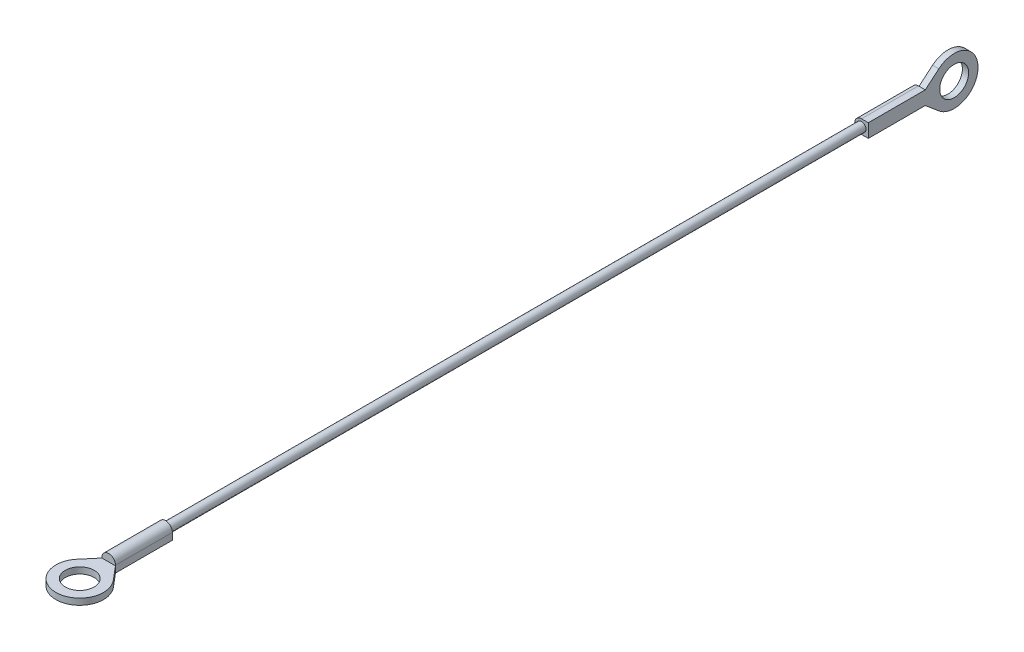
ISO-10303-21;
HEADER;
FILE_DESCRIPTION(('STEP AP214'),'2;1');
FILE_NAME('part.step','',(''),(''),'','','');
FILE_SCHEMA(('AUTOMOTIVE_DESIGN { 1 0 10303 214 1 1 1 1 }'));
ENDSEC;
DATA;
#1=APPLICATION_CONTEXT('core data for automotive mechanical design processes');
#2=APPLICATION_PROTOCOL_DEFINITION('international standard','automotive_design',2000,#1);
#3=PRODUCT_CONTEXT('',#1,'mechanical');
#4=PRODUCT('Part','Part','',(#3));
#5=PRODUCT_RELATED_PRODUCT_CATEGORY('part','',(#4));
#6=PRODUCT_DEFINITION_FORMATION('','',#4);
#7=PRODUCT_DEFINITION_CONTEXT('part definition',#1,'design');
#8=PRODUCT_DEFINITION('design','',#6,#7);
#9=PRODUCT_DEFINITION_SHAPE('','',#8);
#10=(LENGTH_UNIT() NAMED_UNIT(*) SI_UNIT(.MILLI.,.METRE.));
#11=(NAMED_UNIT(*) PLANE_ANGLE_UNIT() SI_UNIT($,.RADIAN.));
#12=(NAMED_UNIT(*) SI_UNIT($,.STERADIAN.) SOLID_ANGLE_UNIT());
#13=UNCERTAINTY_MEASURE_WITH_UNIT(LENGTH_MEASURE(1.E-05),#10,'distance_accuracy_value','');
#14=(GEOMETRIC_REPRESENTATION_CONTEXT(3) GLOBAL_UNCERTAINTY_ASSIGNED_CONTEXT((#13)) GLOBAL_UNIT_ASSIGNED_CONTEXT((#10,
#11,#12)) REPRESENTATION_CONTEXT('',''));
#15=CARTESIAN_POINT('',(0.,0.,0.));
#16=DIRECTION('',(0.,0.,1.));
#17=DIRECTION('',(1.,0.,0.));
#18=AXIS2_PLACEMENT_3D('',#15,#16,#17);
#19=CARTESIAN_POINT('',(0.,0.,-71.12));
#20=DIRECTION('',(0.,0.,-1.));
#21=DIRECTION('',(-1.,0.,0.));
#22=AXIS2_PLACEMENT_3D('',#19,#20,#21);
#23=PLANE('',#22);
#24=DIRECTION('',(1.,0.,0.));
#25=VECTOR('',#24,1.);
#26=CARTESIAN_POINT('',(0.,1.195,-71.12));
#27=LINE('',#26,#25);
#28=CARTESIAN_POINT('',(0.,1.195,-71.12));
#29=VERTEX_POINT('',#28);
#30=CARTESIAN_POINT('',(0.095,1.195,-71.12));
#31=VERTEX_POINT('',#30);
#32=EDGE_CURVE('E195',#29,#31,#27,.T.);
#33=ORIENTED_EDGE('',*,*,#32,.T.);
#34=DIRECTION('',(0.,-1.,0.));
#35=VECTOR('',#34,1.);
#36=CARTESIAN_POINT('',(0.095,-1.195,-71.12));
#37=LINE('',#36,#35);
#38=CARTESIAN_POINT('',(0.095,-1.195,-71.12));
#39=VERTEX_POINT('',#38);
#40=EDGE_CURVE('E153',#31,#39,#37,.T.);
#41=ORIENTED_EDGE('',*,*,#40,.T.);
#42=DIRECTION('',(-1.,0.,0.));
#43=VECTOR('',#42,1.);
#44=CARTESIAN_POINT('',(1.195,-1.195,-71.12));
#45=LINE('',#44,#43);
#46=CARTESIAN_POINT('',(0.,-1.195,-71.12));
#47=VERTEX_POINT('',#46);
#48=EDGE_CURVE('E200',#39,#47,#45,.T.);
#49=ORIENTED_EDGE('',*,*,#48,.T.);
#50=CARTESIAN_POINT('',(0.,0.,-71.12));
#51=DIRECTION('',(0.,0.,-1.));
#52=DIRECTION('',(-1.,0.,0.));
#53=AXIS2_PLACEMENT_3D('',#50,#51,#52);
#54=CIRCLE('',#53,1.195);
#55=EDGE_CURVE('E191',#47,#29,#54,.T.);
#56=ORIENTED_EDGE('',*,*,#55,.T.);
#57=EDGE_LOOP('',(#33,#41,#49,#56));
#58=FACE_BOUND('',#57,.T.);
#59=ADVANCED_FACE('F38',(#58),#23,.T.);
#60=CARTESIAN_POINT('',(0.,0.,71.12));
#61=DIRECTION('',(0.,0.,1.));
#62=DIRECTION('',(1.,0.,0.));
#63=AXIS2_PLACEMENT_3D('',#60,#61,#62);
#64=PLANE('',#63);
#65=DIRECTION('',(0.,-1.,0.));
#66=VECTOR('',#65,1.);
#67=CARTESIAN_POINT('',(-1.195,0.,71.12));
#68=LINE('',#67,#66);
#69=CARTESIAN_POINT('',(-1.195,0.,71.12));
#70=VERTEX_POINT('',#69);
#71=CARTESIAN_POINT('',(-1.195,-0.095,71.12));
#72=VERTEX_POINT('',#71);
#73=EDGE_CURVE('E279',#70,#72,#68,.T.);
#74=ORIENTED_EDGE('',*,*,#73,.T.);
#75=DIRECTION('',(1.,0.,0.));
#76=VECTOR('',#75,1.);
#77=CARTESIAN_POINT('',(-1.195,-0.095,71.12));
#78=LINE('',#77,#76);
#79=CARTESIAN_POINT('',(1.195,-0.095,71.12));
#80=VERTEX_POINT('',#79);
#81=EDGE_CURVE('E240',#72,#80,#78,.T.);
#82=ORIENTED_EDGE('',*,*,#81,.T.);
#83=DIRECTION('',(0.,1.,0.));
#84=VECTOR('',#83,1.);
#85=CARTESIAN_POINT('',(1.195,-1.195,71.12));
#86=LINE('',#85,#84);
#87=CARTESIAN_POINT('',(1.195,0.,71.12));
#88=VERTEX_POINT('',#87);
#89=EDGE_CURVE('E284',#80,#88,#86,.T.);
#90=ORIENTED_EDGE('',*,*,#89,.T.);
#91=CARTESIAN_POINT('',(0.,0.,71.12));
#92=DIRECTION('',(0.,0.,1.));
#93=DIRECTION('',(1.,0.,0.));
#94=AXIS2_PLACEMENT_3D('',#91,#92,#93);
#95=CIRCLE('',#94,1.195);
#96=EDGE_CURVE('E275',#88,#70,#95,.T.);
#97=ORIENTED_EDGE('',*,*,#96,.T.);
#98=EDGE_LOOP('',(#74,#82,#90,#97));
#99=FACE_BOUND('',#98,.T.);
#100=ADVANCED_FACE('F338',(#99),#64,.T.);
#101=CARTESIAN_POINT('',(0.,0.,61.12));
#102=DIRECTION('',(0.,0.,-1.));
#103=DIRECTION('',(-1.,0.,0.));
#104=AXIS2_PLACEMENT_3D('',#101,#102,#103);
#105=CYLINDRICAL_SURFACE('',#104,0.795);
#106=CARTESIAN_POINT('',(0.,0.,61.12));
#107=DIRECTION('',(0.,0.,1.));
#108=DIRECTION('',(1.,0.,0.));
#109=AXIS2_PLACEMENT_3D('',#106,#107,#108);
#110=CIRCLE('',#109,0.795);
#111=CARTESIAN_POINT('',(-0.795,0.,61.12));
#112=VERTEX_POINT('',#111);
#113=EDGE_CURVE('E11',#112,#112,#110,.T.);
#114=CARTESIAN_POINT('',(0.,0.,-61.12));
#115=DIRECTION('',(0.,0.,1.));
#116=DIRECTION('',(1.,0.,0.));
#117=AXIS2_PLACEMENT_3D('',#114,#115,#116);
#118=CIRCLE('',#117,0.795);
#119=CARTESIAN_POINT('',(-0.795,0.,-61.12));
#120=VERTEX_POINT('',#119);
#121=EDGE_CURVE('E42',#120,#120,#118,.T.);
#122=CARTESIAN_POINT('',(-0.795,0.,61.12));
#123=CARTESIAN_POINT('',(-0.795,0.,59.8466666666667));
#124=CARTESIAN_POINT('',(-0.795,0.,58.5733333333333));
#125=CARTESIAN_POINT('',(-0.795,0.,56.0266666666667));
#126=CARTESIAN_POINT('',(-0.795,0.,54.7533333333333));
#127=CARTESIAN_POINT('',(-0.795,0.,52.2066666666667));
#128=CARTESIAN_POINT('',(-0.795,0.,50.9333333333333));
#129=CARTESIAN_POINT('',(-0.795,0.,48.3866666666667));
#130=CARTESIAN_POINT('',(-0.795,0.,47.1133333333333));
#131=CARTESIAN_POINT('',(-0.795,0.,44.5666666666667));
#132=CARTESIAN_POINT('',(-0.795,0.,43.2933333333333));
#133=CARTESIAN_POINT('',(-0.795,0.,40.7466666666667));
#134=CARTESIAN_POINT('',(-0.795,0.,39.4733333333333));
#135=CARTESIAN_POINT('',(-0.795,0.,36.9266666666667));
#136=CARTESIAN_POINT('',(-0.795,0.,35.6533333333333));
#137=CARTESIAN_POINT('',(-0.795,0.,33.1066666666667));
#138=CARTESIAN_POINT('',(-0.795,0.,31.8333333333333));
#139=CARTESIAN_POINT('',(-0.795,0.,29.2866666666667));
#140=CARTESIAN_POINT('',(-0.795,0.,28.0133333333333));
#141=CARTESIAN_POINT('',(-0.795,0.,25.4666666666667));
#142=CARTESIAN_POINT('',(-0.795,0.,24.1933333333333));
#143=CARTESIAN_POINT('',(-0.795,0.,21.6466666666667));
#144=CARTESIAN_POINT('',(-0.795,0.,20.3733333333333));
#145=CARTESIAN_POINT('',(-0.795,0.,17.8266666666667));
#146=CARTESIAN_POINT('',(-0.795,0.,16.5533333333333));
#147=CARTESIAN_POINT('',(-0.795,0.,14.0066666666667));
#148=CARTESIAN_POINT('',(-0.795,0.,12.7333333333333));
#149=CARTESIAN_POINT('',(-0.795,0.,10.1866666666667));
#150=CARTESIAN_POINT('',(-0.795,0.,8.91333333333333));
#151=CARTESIAN_POINT('',(-0.795,0.,6.36666666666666));
#152=CARTESIAN_POINT('',(-0.795,0.,5.09333333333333));
#153=CARTESIAN_POINT('',(-0.795,0.,2.54666666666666));
#154=CARTESIAN_POINT('',(-0.795,0.,1.27333333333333));
#155=CARTESIAN_POINT('',(-0.795,0.,-1.27333333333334));
#156=CARTESIAN_POINT('',(-0.795,0.,-2.54666666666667));
#157=CARTESIAN_POINT('',(-0.795,0.,-5.09333333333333));
#158=CARTESIAN_POINT('',(-0.795,0.,-6.36666666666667));
#159=CARTESIAN_POINT('',(-0.795,0.,-8.91333333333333));
#160=CARTESIAN_POINT('',(-0.795,0.,-10.1866666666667));
#161=CARTESIAN_POINT('',(-0.795,0.,-12.7333333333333));
#162=CARTESIAN_POINT('',(-0.795,0.,-14.0066666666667));
#163=CARTESIAN_POINT('',(-0.795,0.,-16.5533333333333));
#164=CARTESIAN_POINT('',(-0.795,0.,-17.8266666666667));
#165=CARTESIAN_POINT('',(-0.795,0.,-20.3733333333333));
#166=CARTESIAN_POINT('',(-0.795,0.,-21.6466666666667));
#167=CARTESIAN_POINT('',(-0.795,0.,-24.1933333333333));
#168=CARTESIAN_POINT('',(-0.795,0.,-25.4666666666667));
#169=CARTESIAN_POINT('',(-0.795,0.,-28.0133333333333));
#170=CARTESIAN_POINT('',(-0.795,0.,-29.2866666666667));
#171=CARTESIAN_POINT('',(-0.795,0.,-31.8333333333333));
#172=CARTESIAN_POINT('',(-0.795,0.,-33.1066666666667));
#173=CARTESIAN_POINT('',(-0.795,0.,-35.6533333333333));
#174=CARTESIAN_POINT('',(-0.795,0.,-36.9266666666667));
#175=CARTESIAN_POINT('',(-0.795,0.,-39.4733333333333));
#176=CARTESIAN_POINT('',(-0.795,0.,-40.7466666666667));
#177=CARTESIAN_POINT('',(-0.795,0.,-43.2933333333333));
#178=CARTESIAN_POINT('',(-0.795,0.,-44.5666666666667));
#179=CARTESIAN_POINT('',(-0.795,0.,-47.1133333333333));
#180=CARTESIAN_POINT('',(-0.795,0.,-48.3866666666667));
#181=CARTESIAN_POINT('',(-0.795,0.,-50.9333333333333));
#182=CARTESIAN_POINT('',(-0.795,0.,-52.2066666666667));
#183=CARTESIAN_POINT('',(-0.795,0.,-54.7533333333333));
#184=CARTESIAN_POINT('',(-0.795,0.,-56.0266666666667));
#185=CARTESIAN_POINT('',(-0.795,0.,-58.5733333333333));
#186=CARTESIAN_POINT('',(-0.795,0.,-59.8466666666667));
#187=CARTESIAN_POINT('',(-0.795,0.,-61.12));
#188=B_SPLINE_CURVE_WITH_KNOTS('',3,(#122,#123,#124,#125,#126,#127,#128,#129,#130,#131,#132,
#133,#134,#135,#136,#137,#138,#139,#140,#141,#142,#143,#144,#145,#146,#147,#148,#149,#150,#151,
#152,#153,#154,#155,#156,#157,#158,#159,#160,#161,#162,#163,#164,#165,#166,#167,#168,#169,#170,
#171,#172,#173,#174,#175,#176,#177,#178,#179,#180,#181,#182,#183,#184,#185,#186,#187),
.UNSPECIFIED.,.F.,.F.,(4,2,2,2,2,2,2,2,2,2,2,2,2,2,2,2,2,2,2,2,2,2,2,2,2,2,2,2,2,2,2,2,4),(0.,
3.82,7.63999999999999,11.46,15.28,19.1,22.92,26.74,30.56,34.38,38.2,42.02,45.84,49.66,53.48,
57.3,61.12,64.94,68.76,72.58,76.4,80.22,84.04,87.86,91.68,95.5,99.32,103.14,106.96,110.78,114.6,
118.42,122.24),.UNSPECIFIED.);
#189=EDGE_CURVE('BSEAM40',#112,#120,#188,.T.);
#190=ORIENTED_EDGE('',*,*,#113,.F.);
#191=ORIENTED_EDGE('',*,*,#121,.T.);
#192=ORIENTED_EDGE('',*,*,#189,.T.);
#193=ORIENTED_EDGE('',*,*,#189,.F.);
#194=EDGE_LOOP('',(#190,#192,#191,#193));
#195=FACE_BOUND('',#194,.T.);
#196=ADVANCED_FACE('F40',(#195),#105,.T.);
#197=CARTESIAN_POINT('',(0.,0.,71.12));
#198=DIRECTION('',(0.,0.,-1.));
#199=DIRECTION('',(-1.,0.,0.));
#200=AXIS2_PLACEMENT_3D('',#197,#198,#199);
#201=CYLINDRICAL_SURFACE('',#200,1.195);
#202=CARTESIAN_POINT('',(0.,0.,61.12));
#203=DIRECTION('',(0.,0.,1.));
#204=DIRECTION('',(1.,0.,0.));
#205=AXIS2_PLACEMENT_3D('',#202,#203,#204);
#206=CIRCLE('',#205,1.195);
#207=CARTESIAN_POINT('',(1.195,0.,61.12));
#208=VERTEX_POINT('',#207);
#209=CARTESIAN_POINT('',(-1.195,0.,61.12));
#210=VERTEX_POINT('',#209);
#211=EDGE_CURVE('E269',#208,#210,#206,.T.);
#212=ORIENTED_EDGE('',*,*,#211,.T.);
#213=DIRECTION('',(0.,0.,-1.));
#214=VECTOR('',#213,1.);
#215=CARTESIAN_POINT('',(-1.195,0.,71.12));
#216=LINE('',#215,#214);
#217=EDGE_CURVE('E48',#70,#210,#216,.T.);
#218=ORIENTED_EDGE('',*,*,#217,.F.);
#219=ORIENTED_EDGE('',*,*,#96,.F.);
#220=DIRECTION('',(0.,0.,-1.));
#221=VECTOR('',#220,1.);
#222=CARTESIAN_POINT('',(1.195,0.,71.12));
#223=LINE('',#222,#221);
#224=EDGE_CURVE('E288',#88,#208,#223,.T.);
#225=ORIENTED_EDGE('',*,*,#224,.T.);
#226=EDGE_LOOP('',(#212,#218,#219,#225));
#227=FACE_BOUND('',#226,.T.);
#228=ADVANCED_FACE('F322',(#227),#201,.T.);
#229=CARTESIAN_POINT('',(-1.195,0.,71.12));
#230=DIRECTION('',(1.,0.,0.));
#231=DIRECTION('',(0.,1.,0.));
#232=AXIS2_PLACEMENT_3D('',#229,#230,#231);
#233=PLANE('',#232);
#234=DIRECTION('',(0.,-1.,0.));
#235=VECTOR('',#234,1.);
#236=CARTESIAN_POINT('',(-1.195,0.,61.12));
#237=LINE('',#236,#235);
#238=CARTESIAN_POINT('',(-1.195,-1.195,61.12));
#239=VERTEX_POINT('',#238);
#240=EDGE_CURVE('E292',#210,#239,#237,.T.);
#241=ORIENTED_EDGE('',*,*,#240,.T.);
#242=DIRECTION('',(0.,0.,-1.));
#243=VECTOR('',#242,1.);
#244=CARTESIAN_POINT('',(-1.195,-1.195,71.12));
#245=LINE('',#244,#243);
#246=CARTESIAN_POINT('',(-1.195,-1.195,71.12));
#247=VERTEX_POINT('',#246);
#248=EDGE_CURVE('E308',#247,#239,#245,.T.);
#249=ORIENTED_EDGE('',*,*,#248,.F.);
#250=DIRECTION('',(0.,-1.,0.));
#251=VECTOR('',#250,1.);
#252=CARTESIAN_POINT('',(-1.195,-0.095,71.12));
#253=LINE('',#252,#251);
#254=EDGE_CURVE('E266',#72,#247,#253,.T.);
#255=ORIENTED_EDGE('',*,*,#254,.F.);
#256=ORIENTED_EDGE('',*,*,#73,.F.);
#257=ORIENTED_EDGE('',*,*,#217,.T.);
#258=EDGE_LOOP('',(#241,#249,#255,#256,#257));
#259=FACE_BOUND('',#258,.T.);
#260=ADVANCED_FACE('F316',(#259),#233,.F.);
#261=CARTESIAN_POINT('',(0.,-1.195,71.12));
#262=DIRECTION('',(0.,1.,0.));
#263=DIRECTION('',(0.,0.,1.));
#264=AXIS2_PLACEMENT_3D('',#261,#262,#263);
#265=PLANE('',#264);
#266=DIRECTION('',(1.,0.,0.));
#267=VECTOR('',#266,1.);
#268=CARTESIAN_POINT('',(0.,-1.195,61.12));
#269=LINE('',#268,#267);
#270=CARTESIAN_POINT('',(1.195,-1.195,61.12));
#271=VERTEX_POINT('',#270);
#272=EDGE_CURVE('E296',#239,#271,#269,.T.);
#273=ORIENTED_EDGE('',*,*,#272,.T.);
#274=DIRECTION('',(0.,0.,-1.));
#275=VECTOR('',#274,1.);
#276=CARTESIAN_POINT('',(1.195,-1.195,71.12));
#277=LINE('',#276,#275);
#278=CARTESIAN_POINT('',(1.195,-1.195,71.12));
#279=VERTEX_POINT('',#278);
#280=EDGE_CURVE('E304',#279,#271,#277,.T.);
#281=ORIENTED_EDGE('',*,*,#280,.F.);
#282=DIRECTION('',(0.645049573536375,0.,0.764140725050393));
#283=VECTOR('',#282,1.);
#284=CARTESIAN_POINT('',(1.195,-1.195,71.12));
#285=LINE('',#284,#283);
#286=CARTESIAN_POINT('',(3.20174963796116,-1.195,73.4972422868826));
#287=VERTEX_POINT('',#286);
#288=EDGE_CURVE('E235',#279,#287,#285,.T.);
#289=ORIENTED_EDGE('',*,*,#288,.T.);
#290=CARTESIAN_POINT('',(0.,-1.195,76.2));
#291=DIRECTION('',(0.,-1.,0.));
#292=DIRECTION('',(0.,0.,-1.));
#293=AXIS2_PLACEMENT_3D('',#290,#291,#292);
#294=CIRCLE('',#293,4.19000000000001);
#295=CARTESIAN_POINT('',(-3.20174963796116,-1.195,73.4972422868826));
#296=VERTEX_POINT('',#295);
#297=EDGE_CURVE('E259',#287,#296,#294,.T.);
#298=ORIENTED_EDGE('',*,*,#297,.T.);
#299=DIRECTION('',(0.645049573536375,0.,-0.764140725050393));
#300=VECTOR('',#299,1.);
#301=CARTESIAN_POINT('',(-3.20174963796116,-1.195,73.4972422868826));
#302=LINE('',#301,#300);
#303=EDGE_CURVE('E244',#296,#247,#302,.T.);
#304=ORIENTED_EDGE('',*,*,#303,.T.);
#305=ORIENTED_EDGE('',*,*,#248,.T.);
#306=EDGE_LOOP('',(#273,#281,#289,#298,#304,#305));
#307=FACE_BOUND('',#306,.T.);
#308=CARTESIAN_POINT('',(0.,-1.195,76.2));
#309=DIRECTION('',(0.,-1.,0.));
#310=DIRECTION('',(0.,0.,-1.));
#311=AXIS2_PLACEMENT_3D('',#308,#309,#310);
#312=CIRCLE('',#311,2.54);
#313=CARTESIAN_POINT('',(0.,-1.195,73.66));
#314=VERTEX_POINT('',#313);
#315=EDGE_CURVE('E236',#314,#314,#312,.T.);
#316=ORIENTED_EDGE('',*,*,#315,.F.);
#317=EDGE_LOOP('',(#316));
#318=FACE_BOUND('',#317,.T.);
#319=ADVANCED_FACE('F329',(#307,#318),#265,.F.);
#320=CARTESIAN_POINT('',(1.195,-1.195,71.12));
#321=DIRECTION('',(-1.,0.,0.));
#322=DIRECTION('',(0.,-1.,0.));
#323=AXIS2_PLACEMENT_3D('',#320,#321,#322);
#324=PLANE('',#323);
#325=DIRECTION('',(0.,1.,0.));
#326=VECTOR('',#325,1.);
#327=CARTESIAN_POINT('',(1.195,-1.195,61.12));
#328=LINE('',#327,#326);
#329=EDGE_CURVE('E280',#271,#208,#328,.T.);
#330=ORIENTED_EDGE('',*,*,#329,.T.);
#331=ORIENTED_EDGE('',*,*,#224,.F.);
#332=ORIENTED_EDGE('',*,*,#89,.F.);
#333=EDGE_CURVE('E285',#279,#80,#86,.T.);
#334=ORIENTED_EDGE('',*,*,#333,.F.);
#335=ORIENTED_EDGE('',*,*,#280,.T.);
#336=EDGE_LOOP('',(#330,#331,#332,#334,#335));
#337=FACE_BOUND('',#336,.T.);
#338=ADVANCED_FACE('F333',(#337),#324,.F.);
#339=CARTESIAN_POINT('',(0.,0.,61.12));
#340=DIRECTION('',(0.,0.,1.));
#341=DIRECTION('',(1.,0.,0.));
#342=AXIS2_PLACEMENT_3D('',#339,#340,#341);
#343=PLANE('',#342);
#344=ORIENTED_EDGE('',*,*,#113,.T.);
#345=EDGE_LOOP('',(#344));
#346=FACE_BOUND('',#345,.T.);
#347=ORIENTED_EDGE('',*,*,#211,.F.);
#348=ORIENTED_EDGE('',*,*,#329,.F.);
#349=ORIENTED_EDGE('',*,*,#272,.F.);
#350=ORIENTED_EDGE('',*,*,#240,.F.);
#351=EDGE_LOOP('',(#347,#348,#349,#350));
#352=FACE_BOUND('',#351,.T.);
#353=ADVANCED_FACE('F326',(#346,#352),#343,.F.);
#354=CARTESIAN_POINT('',(-3.20174963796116,-0.095,73.4972422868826));
#355=DIRECTION('',(-0.764140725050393,0.,-0.645049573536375));
#356=DIRECTION('',(-0.645049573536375,0.,0.764140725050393));
#357=AXIS2_PLACEMENT_3D('',#354,#355,#356);
#358=PLANE('',#357);
#359=ORIENTED_EDGE('',*,*,#303,.F.);
#360=DIRECTION('',(0.,-1.,0.));
#361=VECTOR('',#360,1.);
#362=CARTESIAN_POINT('',(-3.20174963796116,-0.095,73.4972422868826));
#363=LINE('',#362,#361);
#364=CARTESIAN_POINT('',(-3.20174963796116,-0.095,73.4972422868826));
#365=VERTEX_POINT('',#364);
#366=EDGE_CURVE('E270',#365,#296,#363,.T.);
#367=ORIENTED_EDGE('',*,*,#366,.F.);
#368=DIRECTION('',(0.645049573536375,0.,-0.764140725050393));
#369=VECTOR('',#368,1.);
#370=CARTESIAN_POINT('',(-3.20174963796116,-0.095,73.4972422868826));
#371=LINE('',#370,#369);
#372=EDGE_CURVE('E251',#365,#72,#371,.T.);
#373=ORIENTED_EDGE('',*,*,#372,.T.);
#374=ORIENTED_EDGE('',*,*,#254,.T.);
#375=EDGE_LOOP('',(#359,#367,#373,#374));
#376=FACE_BOUND('',#375,.T.);
#377=ADVANCED_FACE('F343',(#376),#358,.T.);
#378=CARTESIAN_POINT('',(0.,-0.095,76.2));
#379=DIRECTION('',(0.,-1.,0.));
#380=DIRECTION('',(0.,0.,-1.));
#381=AXIS2_PLACEMENT_3D('',#378,#379,#380);
#382=CYLINDRICAL_SURFACE('',#381,4.19000000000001);
#383=ORIENTED_EDGE('',*,*,#297,.F.);
#384=DIRECTION('',(0.,-1.,0.));
#385=VECTOR('',#384,1.);
#386=CARTESIAN_POINT('',(3.20174963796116,-0.095,73.4972422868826));
#387=LINE('',#386,#385);
#388=CARTESIAN_POINT('',(3.20174963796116,-0.095,73.4972422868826));
#389=VERTEX_POINT('',#388);
#390=EDGE_CURVE('E255',#389,#287,#387,.T.);
#391=ORIENTED_EDGE('',*,*,#390,.F.);
#392=CARTESIAN_POINT('',(0.,-0.095,76.2));
#393=DIRECTION('',(0.,-1.,0.));
#394=DIRECTION('',(0.,0.,-1.));
#395=AXIS2_PLACEMENT_3D('',#392,#393,#394);
#396=CIRCLE('',#395,4.19000000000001);
#397=EDGE_CURVE('E247',#389,#365,#396,.T.);
#398=ORIENTED_EDGE('',*,*,#397,.T.);
#399=ORIENTED_EDGE('',*,*,#366,.T.);
#400=EDGE_LOOP('',(#383,#391,#398,#399));
#401=FACE_BOUND('',#400,.T.);
#402=ADVANCED_FACE('F346',(#401),#382,.T.);
#403=CARTESIAN_POINT('',(1.195,-0.095,71.12));
#404=DIRECTION('',(0.764140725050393,0.,-0.645049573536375));
#405=DIRECTION('',(-0.645049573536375,0.,-0.764140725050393));
#406=AXIS2_PLACEMENT_3D('',#403,#404,#405);
#407=PLANE('',#406);
#408=ORIENTED_EDGE('',*,*,#288,.F.);
#409=ORIENTED_EDGE('',*,*,#333,.T.);
#410=DIRECTION('',(0.645049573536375,0.,0.764140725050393));
#411=VECTOR('',#410,1.);
#412=CARTESIAN_POINT('',(1.195,-0.095,71.12));
#413=LINE('',#412,#411);
#414=EDGE_CURVE('E63',#80,#389,#413,.T.);
#415=ORIENTED_EDGE('',*,*,#414,.T.);
#416=ORIENTED_EDGE('',*,*,#390,.T.);
#417=EDGE_LOOP('',(#408,#409,#415,#416));
#418=FACE_BOUND('',#417,.T.);
#419=ADVANCED_FACE('F336',(#418),#407,.T.);
#420=CARTESIAN_POINT('',(0.,-0.095,76.2));
#421=DIRECTION('',(0.,-1.,0.));
#422=DIRECTION('',(0.,0.,-1.));
#423=AXIS2_PLACEMENT_3D('',#420,#421,#422);
#424=PLANE('',#423);
#425=CARTESIAN_POINT('',(0.,-0.095,76.2));
#426=DIRECTION('',(0.,-1.,0.));
#427=DIRECTION('',(0.,0.,-1.));
#428=AXIS2_PLACEMENT_3D('',#425,#426,#427);
#429=CIRCLE('',#428,2.54);
#430=CARTESIAN_POINT('',(0.,-0.095,73.66));
#431=VERTEX_POINT('',#430);
#432=EDGE_CURVE('E231',#431,#431,#429,.T.);
#433=ORIENTED_EDGE('',*,*,#432,.T.);
#434=EDGE_LOOP('',(#433));
#435=FACE_BOUND('',#434,.T.);
#436=ORIENTED_EDGE('',*,*,#81,.F.);
#437=ORIENTED_EDGE('',*,*,#372,.F.);
#438=ORIENTED_EDGE('',*,*,#397,.F.);
#439=ORIENTED_EDGE('',*,*,#414,.F.);
#440=EDGE_LOOP('',(#436,#437,#438,#439));
#441=FACE_BOUND('',#440,.T.);
#442=ADVANCED_FACE('F340',(#435,#441),#424,.F.);
#443=CARTESIAN_POINT('',(0.,-0.095,76.2));
#444=DIRECTION('',(0.,-1.,0.));
#445=DIRECTION('',(0.,0.,-1.));
#446=AXIS2_PLACEMENT_3D('',#443,#444,#445);
#447=CYLINDRICAL_SURFACE('',#446,2.54);
#448=ORIENTED_EDGE('',*,*,#432,.F.);
#449=EDGE_LOOP('',(#448));
#450=FACE_BOUND('',#449,.T.);
#451=ORIENTED_EDGE('',*,*,#315,.T.);
#452=EDGE_LOOP('',(#451));
#453=FACE_BOUND('',#452,.T.);
#454=ADVANCED_FACE('F384',(#450,#453),#447,.F.);
#455=CARTESIAN_POINT('',(0.,0.,-71.12));
#456=DIRECTION('',(0.,0.,1.));
#457=DIRECTION('',(1.,0.,0.));
#458=AXIS2_PLACEMENT_3D('',#455,#456,#457);
#459=CYLINDRICAL_SURFACE('',#458,1.195);
#460=CARTESIAN_POINT('',(0.,0.,-61.12));
#461=DIRECTION('',(0.,0.,-1.));
#462=DIRECTION('',(-1.,0.,0.));
#463=AXIS2_PLACEMENT_3D('',#460,#461,#462);
#464=CIRCLE('',#463,1.195);
#465=CARTESIAN_POINT('',(0.,-1.195,-61.12));
#466=VERTEX_POINT('',#465);
#467=CARTESIAN_POINT('',(0.,1.195,-61.12));
#468=VERTEX_POINT('',#467);
#469=EDGE_CURVE('E188',#466,#468,#464,.T.);
#470=ORIENTED_EDGE('',*,*,#469,.T.);
#471=DIRECTION('',(0.,0.,1.));
#472=VECTOR('',#471,1.);
#473=CARTESIAN_POINT('',(0.,1.195,-71.12));
#474=LINE('',#473,#472);
#475=EDGE_CURVE('E227',#29,#468,#474,.T.);
#476=ORIENTED_EDGE('',*,*,#475,.F.);
#477=ORIENTED_EDGE('',*,*,#55,.F.);
#478=DIRECTION('',(0.,0.,1.));
#479=VECTOR('',#478,1.);
#480=CARTESIAN_POINT('',(0.,-1.195,-71.12));
#481=LINE('',#480,#479);
#482=EDGE_CURVE('E203',#47,#466,#481,.T.);
#483=ORIENTED_EDGE('',*,*,#482,.T.);
#484=EDGE_LOOP('',(#470,#476,#477,#483));
#485=FACE_BOUND('',#484,.T.);
#486=ADVANCED_FACE('F380',(#485),#459,.T.);
#487=CARTESIAN_POINT('',(0.,1.195,-71.12));
#488=DIRECTION('',(0.,-1.,0.));
#489=DIRECTION('',(0.,0.,-1.));
#490=AXIS2_PLACEMENT_3D('',#487,#488,#489);
#491=PLANE('',#490);
#492=DIRECTION('',(1.,0.,0.));
#493=VECTOR('',#492,1.);
#494=CARTESIAN_POINT('',(0.,1.195,-61.12));
#495=LINE('',#494,#493);
#496=CARTESIAN_POINT('',(1.195,1.195,-61.12));
#497=VERTEX_POINT('',#496);
#498=EDGE_CURVE('E207',#468,#497,#495,.T.);
#499=ORIENTED_EDGE('',*,*,#498,.T.);
#500=DIRECTION('',(0.,0.,1.));
#501=VECTOR('',#500,1.);
#502=CARTESIAN_POINT('',(1.195,1.195,-71.12));
#503=LINE('',#502,#501);
#504=CARTESIAN_POINT('',(1.195,1.195,-71.12));
#505=VERTEX_POINT('',#504);
#506=EDGE_CURVE('E223',#505,#497,#503,.T.);
#507=ORIENTED_EDGE('',*,*,#506,.F.);
#508=DIRECTION('',(1.,0.,0.));
#509=VECTOR('',#508,1.);
#510=CARTESIAN_POINT('',(0.095,1.195,-71.12));
#511=LINE('',#510,#509);
#512=EDGE_CURVE('E185',#31,#505,#511,.T.);
#513=ORIENTED_EDGE('',*,*,#512,.F.);
#514=ORIENTED_EDGE('',*,*,#32,.F.);
#515=ORIENTED_EDGE('',*,*,#475,.T.);
#516=EDGE_LOOP('',(#499,#507,#513,#514,#515));
#517=FACE_BOUND('',#516,.T.);
#518=ADVANCED_FACE('F376',(#517),#491,.F.);
#519=CARTESIAN_POINT('',(1.195,0.,-71.12));
#520=DIRECTION('',(-1.,0.,0.));
#521=DIRECTION('',(0.,-1.,0.));
#522=AXIS2_PLACEMENT_3D('',#519,#520,#521);
#523=PLANE('',#522);
#524=DIRECTION('',(0.,-1.,0.));
#525=VECTOR('',#524,1.);
#526=CARTESIAN_POINT('',(1.195,0.,-61.12));
#527=LINE('',#526,#525);
#528=CARTESIAN_POINT('',(1.195,-1.195,-61.12));
#529=VERTEX_POINT('',#528);
#530=EDGE_CURVE('E211',#497,#529,#527,.T.);
#531=ORIENTED_EDGE('',*,*,#530,.T.);
#532=DIRECTION('',(0.,0.,1.));
#533=VECTOR('',#532,1.);
#534=CARTESIAN_POINT('',(1.195,-1.195,-71.12));
#535=LINE('',#534,#533);
#536=CARTESIAN_POINT('',(1.195,-1.195,-71.12));
#537=VERTEX_POINT('',#536);
#538=EDGE_CURVE('E219',#537,#529,#535,.T.);
#539=ORIENTED_EDGE('',*,*,#538,.F.);
#540=DIRECTION('',(0.,-0.645049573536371,-0.764140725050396));
#541=VECTOR('',#540,1.);
#542=CARTESIAN_POINT('',(1.195,-3.20174963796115,-73.4972422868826));
#543=LINE('',#542,#541);
#544=CARTESIAN_POINT('',(1.195,-3.20174963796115,-73.4972422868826));
#545=VERTEX_POINT('',#544);
#546=EDGE_CURVE('E179',#537,#545,#543,.T.);
#547=ORIENTED_EDGE('',*,*,#546,.T.);
#548=CARTESIAN_POINT('',(1.195,0.,-76.2));
#549=DIRECTION('',(1.,0.,0.));
#550=DIRECTION('',(0.,0.,1.));
#551=AXIS2_PLACEMENT_3D('',#548,#549,#550);
#552=CIRCLE('',#551,4.18999999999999);
#553=CARTESIAN_POINT('',(1.195,3.20174963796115,-73.4972422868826));
#554=VERTEX_POINT('',#553);
#555=EDGE_CURVE('E148',#545,#554,#552,.T.);
#556=ORIENTED_EDGE('',*,*,#555,.T.);
#557=DIRECTION('',(0.,-0.645049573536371,0.764140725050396));
#558=VECTOR('',#557,1.);
#559=CARTESIAN_POINT('',(1.195,1.195,-71.12));
#560=LINE('',#559,#558);
#561=EDGE_CURVE('E165',#554,#505,#560,.T.);
#562=ORIENTED_EDGE('',*,*,#561,.T.);
#563=ORIENTED_EDGE('',*,*,#506,.T.);
#564=EDGE_LOOP('',(#531,#539,#547,#556,#562,#563));
#565=FACE_BOUND('',#564,.T.);
#566=CARTESIAN_POINT('',(1.195,0.,-76.2));
#567=DIRECTION('',(1.,0.,0.));
#568=DIRECTION('',(0.,0.,-1.));
#569=AXIS2_PLACEMENT_3D('',#566,#567,#568);
#570=CIRCLE('',#569,2.54);
#571=CARTESIAN_POINT('',(1.195,0.,-78.74));
#572=VERTEX_POINT('',#571);
#573=EDGE_CURVE('E172',#572,#572,#570,.T.);
#574=ORIENTED_EDGE('',*,*,#573,.F.);
#575=EDGE_LOOP('',(#574));
#576=FACE_BOUND('',#575,.T.);
#577=ADVANCED_FACE('F372',(#565,#576),#523,.F.);
#578=CARTESIAN_POINT('',(1.195,-1.195,-71.12));
#579=DIRECTION('',(0.,1.,0.));
#580=DIRECTION('',(0.,0.,1.));
#581=AXIS2_PLACEMENT_3D('',#578,#579,#580);
#582=PLANE('',#581);
#583=DIRECTION('',(-1.,0.,0.));
#584=VECTOR('',#583,1.);
#585=CARTESIAN_POINT('',(1.195,-1.195,-61.12));
#586=LINE('',#585,#584);
#587=EDGE_CURVE('E196',#529,#466,#586,.T.);
#588=ORIENTED_EDGE('',*,*,#587,.T.);
#589=ORIENTED_EDGE('',*,*,#482,.F.);
#590=ORIENTED_EDGE('',*,*,#48,.F.);
#591=EDGE_CURVE('E162',#537,#39,#45,.T.);
#592=ORIENTED_EDGE('',*,*,#591,.F.);
#593=ORIENTED_EDGE('',*,*,#538,.T.);
#594=EDGE_LOOP('',(#588,#589,#590,#592,#593));
#595=FACE_BOUND('',#594,.T.);
#596=ADVANCED_FACE('F368',(#595),#582,.F.);
#597=CARTESIAN_POINT('',(0.,0.,-61.12));
#598=DIRECTION('',(0.,0.,-1.));
#599=DIRECTION('',(-1.,0.,0.));
#600=AXIS2_PLACEMENT_3D('',#597,#598,#599);
#601=PLANE('',#600);
#602=ORIENTED_EDGE('',*,*,#121,.F.);
#603=EDGE_LOOP('',(#602));
#604=FACE_BOUND('',#603,.T.);
#605=ORIENTED_EDGE('',*,*,#469,.F.);
#606=ORIENTED_EDGE('',*,*,#587,.F.);
#607=ORIENTED_EDGE('',*,*,#530,.F.);
#608=ORIENTED_EDGE('',*,*,#498,.F.);
#609=EDGE_LOOP('',(#605,#606,#607,#608));
#610=FACE_BOUND('',#609,.T.);
#611=ADVANCED_FACE('F365',(#604,#610),#601,.F.);
#612=CARTESIAN_POINT('',(0.095,-3.20174963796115,-73.4972422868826));
#613=DIRECTION('',(0.,-0.764140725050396,0.645049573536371));
#614=DIRECTION('',(0.,-0.645049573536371,-0.764140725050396));
#615=AXIS2_PLACEMENT_3D('',#612,#613,#614);
#616=PLANE('',#615);
#617=ORIENTED_EDGE('',*,*,#546,.F.);
#618=ORIENTED_EDGE('',*,*,#591,.T.);
#619=DIRECTION('',(0.,-0.645049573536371,-0.764140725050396));
#620=VECTOR('',#619,1.);
#621=CARTESIAN_POINT('',(0.095,-3.20174963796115,-73.4972422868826));
#622=LINE('',#621,#620);
#623=CARTESIAN_POINT('',(0.095,-3.20174963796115,-73.4972422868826));
#624=VERTEX_POINT('',#623);
#625=EDGE_CURVE('E55',#39,#624,#622,.T.);
#626=ORIENTED_EDGE('',*,*,#625,.T.);
#627=DIRECTION('',(1.,0.,0.));
#628=VECTOR('',#627,1.);
#629=CARTESIAN_POINT('',(0.095,-3.20174963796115,-73.4972422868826));
#630=LINE('',#629,#628);
#631=EDGE_CURVE('E144',#624,#545,#630,.T.);
#632=ORIENTED_EDGE('',*,*,#631,.T.);
#633=EDGE_LOOP('',(#617,#618,#626,#632));
#634=FACE_BOUND('',#633,.T.);
#635=ADVANCED_FACE('F160',(#634),#616,.T.);
#636=CARTESIAN_POINT('',(0.095,1.195,-71.12));
#637=DIRECTION('',(0.,0.764140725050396,0.645049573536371));
#638=DIRECTION('',(0.,-0.645049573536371,0.764140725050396));
#639=AXIS2_PLACEMENT_3D('',#636,#637,#638);
#640=PLANE('',#639);
#641=ORIENTED_EDGE('',*,*,#561,.F.);
#642=DIRECTION('',(1.,0.,0.));
#643=VECTOR('',#642,1.);
#644=CARTESIAN_POINT('',(0.095,3.20174963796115,-73.4972422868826));
#645=LINE('',#644,#643);
#646=CARTESIAN_POINT('',(0.095,3.20174963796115,-73.4972422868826));
#647=VERTEX_POINT('',#646);
#648=EDGE_CURVE('E152',#647,#554,#645,.T.);
#649=ORIENTED_EDGE('',*,*,#648,.F.);
#650=DIRECTION('',(0.,-0.645049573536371,0.764140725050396));
#651=VECTOR('',#650,1.);
#652=CARTESIAN_POINT('',(0.095,1.195,-71.12));
#653=LINE('',#652,#651);
#654=EDGE_CURVE('E157',#647,#31,#653,.T.);
#655=ORIENTED_EDGE('',*,*,#654,.T.);
#656=ORIENTED_EDGE('',*,*,#512,.T.);
#657=EDGE_LOOP('',(#641,#649,#655,#656));
#658=FACE_BOUND('',#657,.T.);
#659=ADVANCED_FACE('F435',(#658),#640,.T.);
#660=CARTESIAN_POINT('',(0.095,0.,-76.2));
#661=DIRECTION('',(1.,0.,0.));
#662=DIRECTION('',(0.,0.,-1.));
#663=AXIS2_PLACEMENT_3D('',#660,#661,#662);
#664=CYLINDRICAL_SURFACE('',#663,4.18999999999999);
#665=ORIENTED_EDGE('',*,*,#555,.F.);
#666=ORIENTED_EDGE('',*,*,#631,.F.);
#667=CARTESIAN_POINT('',(0.095,0.,-76.2));
#668=DIRECTION('',(1.,0.,0.));
#669=DIRECTION('',(0.,0.,1.));
#670=AXIS2_PLACEMENT_3D('',#667,#668,#669);
#671=CIRCLE('',#670,4.18999999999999);
#672=EDGE_CURVE('E146',#624,#647,#671,.T.);
#673=ORIENTED_EDGE('',*,*,#672,.T.);
#674=ORIENTED_EDGE('',*,*,#648,.T.);
#675=EDGE_LOOP('',(#665,#666,#673,#674));
#676=FACE_BOUND('',#675,.T.);
#677=ADVANCED_FACE('F145',(#676),#664,.T.);
#678=CARTESIAN_POINT('',(0.095,0.,-76.2));
#679=DIRECTION('',(-1.,0.,0.));
#680=DIRECTION('',(0.,0.,1.));
#681=AXIS2_PLACEMENT_3D('',#678,#679,#680);
#682=PLANE('',#681);
#683=CARTESIAN_POINT('',(0.095,0.,-76.2));
#684=DIRECTION('',(1.,0.,0.));
#685=DIRECTION('',(0.,0.,-1.));
#686=AXIS2_PLACEMENT_3D('',#683,#684,#685);
#687=CIRCLE('',#686,2.54);
#688=CARTESIAN_POINT('',(0.095,0.,-78.74));
#689=VERTEX_POINT('',#688);
#690=EDGE_CURVE('E182',#689,#689,#687,.T.);
#691=ORIENTED_EDGE('',*,*,#690,.T.);
#692=EDGE_LOOP('',(#691));
#693=FACE_BOUND('',#692,.T.);
#694=ORIENTED_EDGE('',*,*,#625,.F.);
#695=ORIENTED_EDGE('',*,*,#40,.F.);
#696=ORIENTED_EDGE('',*,*,#654,.F.);
#697=ORIENTED_EDGE('',*,*,#672,.F.);
#698=EDGE_LOOP('',(#694,#695,#696,#697));
#699=FACE_BOUND('',#698,.T.);
#700=ADVANCED_FACE('F156',(#693,#699),#682,.T.);
#701=CARTESIAN_POINT('',(0.095,0.,-76.2));
#702=DIRECTION('',(1.,0.,0.));
#703=DIRECTION('',(0.,0.,-1.));
#704=AXIS2_PLACEMENT_3D('',#701,#702,#703);
#705=CYLINDRICAL_SURFACE('',#704,2.54);
#706=ORIENTED_EDGE('',*,*,#690,.F.);
#707=EDGE_LOOP('',(#706));
#708=FACE_BOUND('',#707,.T.);
#709=ORIENTED_EDGE('',*,*,#573,.T.);
#710=EDGE_LOOP('',(#709));
#711=FACE_BOUND('',#710,.T.);
#712=ADVANCED_FACE('F425',(#708,#711),#705,.F.);
#713=CLOSED_SHELL('',(#59,#100,#196,#228,#260,#319,#338,#353,#377,#402,#419,#442,#454,#486,#518,
#577,#596,#611,#635,#659,#677,#700,#712));
#714=MANIFOLD_SOLID_BREP('B2',#713);
#715=ADVANCED_BREP_SHAPE_REPRESENTATION('',(#18,#714),#14);
#716=SHAPE_DEFINITION_REPRESENTATION(#9,#715);
ENDSEC;
END-ISO-10303-21;
